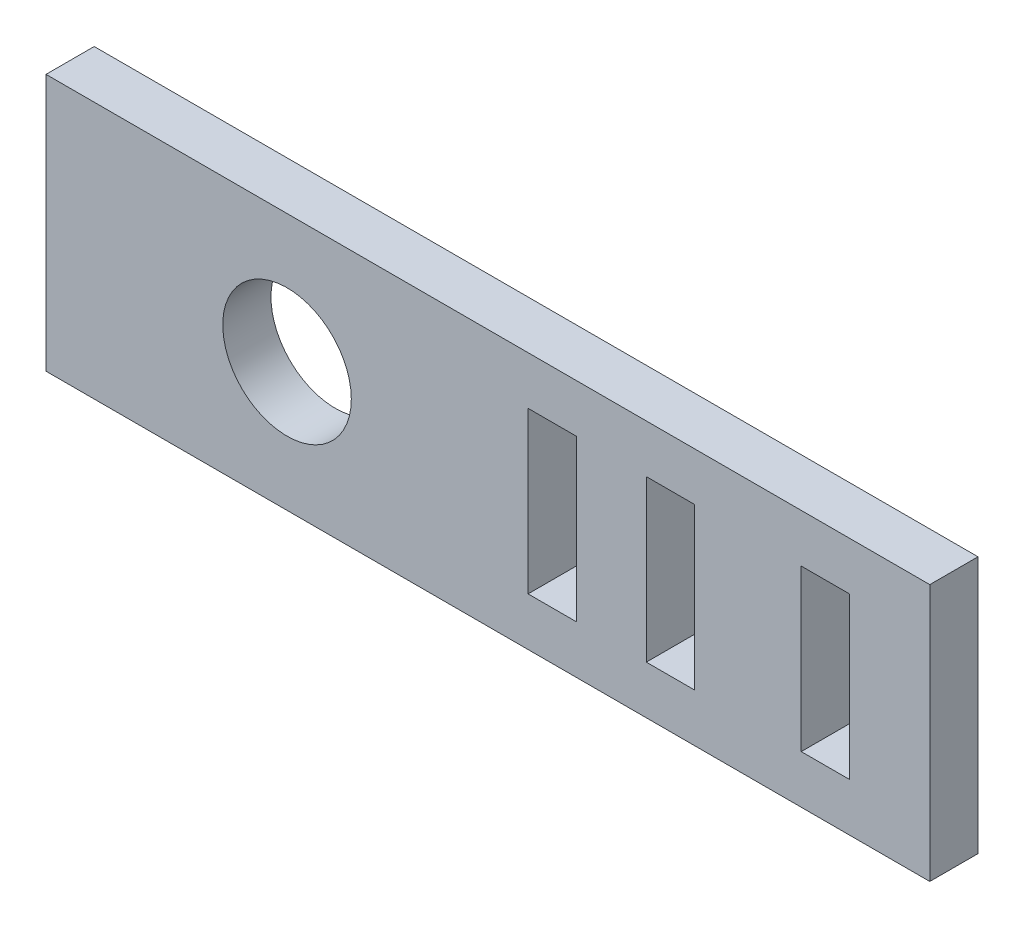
ISO-10303-21;
HEADER;
FILE_DESCRIPTION(('STEP AP214'),'2;1');
FILE_NAME('part.step','',(''),(''),'','','');
FILE_SCHEMA(('AUTOMOTIVE_DESIGN { 1 0 10303 214 1 1 1 1 }'));
ENDSEC;
DATA;
#1=APPLICATION_CONTEXT('core data for automotive mechanical design processes');
#2=APPLICATION_PROTOCOL_DEFINITION('international standard','automotive_design',2000,#1);
#3=PRODUCT_CONTEXT('',#1,'mechanical');
#4=PRODUCT('Part','Part','',(#3));
#5=PRODUCT_RELATED_PRODUCT_CATEGORY('part','',(#4));
#6=PRODUCT_DEFINITION_FORMATION('','',#4);
#7=PRODUCT_DEFINITION_CONTEXT('part definition',#1,'design');
#8=PRODUCT_DEFINITION('design','',#6,#7);
#9=PRODUCT_DEFINITION_SHAPE('','',#8);
#10=(LENGTH_UNIT() NAMED_UNIT(*) SI_UNIT(.MILLI.,.METRE.));
#11=(NAMED_UNIT(*) PLANE_ANGLE_UNIT() SI_UNIT($,.RADIAN.));
#12=(NAMED_UNIT(*) SI_UNIT($,.STERADIAN.) SOLID_ANGLE_UNIT());
#13=UNCERTAINTY_MEASURE_WITH_UNIT(LENGTH_MEASURE(1.E-05),#10,'distance_accuracy_value','');
#14=(GEOMETRIC_REPRESENTATION_CONTEXT(3) GLOBAL_UNCERTAINTY_ASSIGNED_CONTEXT((#13)) GLOBAL_UNIT_ASSIGNED_CONTEXT((#10,
#11,#12)) REPRESENTATION_CONTEXT('',''));
#15=CARTESIAN_POINT('',(0.,0.,0.));
#16=DIRECTION('',(0.,0.,1.));
#17=DIRECTION('',(1.,0.,0.));
#18=AXIS2_PLACEMENT_3D('',#15,#16,#17);
#19=CARTESIAN_POINT('',(0.,0.,0.));
#20=DIRECTION('',(0.,0.,-1.));
#21=DIRECTION('',(-1.,0.,0.));
#22=AXIS2_PLACEMENT_3D('',#19,#20,#21);
#23=PLANE('',#22);
#24=DIRECTION('',(0.,-1.,0.));
#25=VECTOR('',#24,1.);
#26=CARTESIAN_POINT('',(-15.,-8.,0.));
#27=LINE('',#26,#25);
#28=CARTESIAN_POINT('',(-15.,7.99999999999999,0.));
#29=VERTEX_POINT('',#28);
#30=CARTESIAN_POINT('',(-15.,-8.,0.));
#31=VERTEX_POINT('',#30);
#32=EDGE_CURVE('E252',#29,#31,#27,.T.);
#33=ORIENTED_EDGE('',*,*,#32,.F.);
#34=DIRECTION('',(-1.,0.,0.));
#35=VECTOR('',#34,1.);
#36=CARTESIAN_POINT('',(-15.,7.99999999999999,0.));
#37=LINE('',#36,#35);
#38=CARTESIAN_POINT('',(40.,8.,0.));
#39=VERTEX_POINT('',#38);
#40=EDGE_CURVE('E259',#39,#29,#37,.T.);
#41=ORIENTED_EDGE('',*,*,#40,.F.);
#42=DIRECTION('',(0.,1.,0.));
#43=VECTOR('',#42,1.);
#44=CARTESIAN_POINT('',(40.,-8.,0.));
#45=LINE('',#44,#43);
#46=CARTESIAN_POINT('',(40.,-8.,0.));
#47=VERTEX_POINT('',#46);
#48=EDGE_CURVE('E270',#47,#39,#45,.T.);
#49=ORIENTED_EDGE('',*,*,#48,.F.);
#50=DIRECTION('',(1.,0.,0.));
#51=VECTOR('',#50,1.);
#52=CARTESIAN_POINT('',(-15.,-8.,0.));
#53=LINE('',#52,#51);
#54=EDGE_CURVE('E268',#31,#47,#53,.T.);
#55=ORIENTED_EDGE('',*,*,#54,.F.);
#56=EDGE_LOOP('',(#33,#41,#49,#55));
#57=FACE_BOUND('',#56,.T.);
#58=CARTESIAN_POINT('',(0.,0.,0.));
#59=DIRECTION('',(0.,0.,1.));
#60=DIRECTION('',(1.,0.,0.));
#61=AXIS2_PLACEMENT_3D('',#58,#59,#60);
#62=CIRCLE('',#61,4.);
#63=CARTESIAN_POINT('',(4.,0.,0.));
#64=VERTEX_POINT('',#63);
#65=EDGE_CURVE('E248',#64,#64,#62,.T.);
#66=ORIENTED_EDGE('',*,*,#65,.T.);
#67=EDGE_LOOP('',(#66));
#68=FACE_BOUND('',#67,.T.);
#69=DIRECTION('',(-1.,0.,0.));
#70=VECTOR('',#69,1.);
#71=CARTESIAN_POINT('',(25.3580315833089,-5.,0.));
#72=LINE('',#71,#70);
#73=CARTESIAN_POINT('',(25.3580315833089,-5.,0.));
#74=VERTEX_POINT('',#73);
#75=CARTESIAN_POINT('',(22.3580315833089,-5.,0.));
#76=VERTEX_POINT('',#75);
#77=EDGE_CURVE('E238',#74,#76,#72,.T.);
#78=ORIENTED_EDGE('',*,*,#77,.F.);
#79=DIRECTION('',(0.,1.,0.));
#80=VECTOR('',#79,1.);
#81=CARTESIAN_POINT('',(25.3580315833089,-5.,0.));
#82=LINE('',#81,#80);
#83=CARTESIAN_POINT('',(25.3580315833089,5.,0.));
#84=VERTEX_POINT('',#83);
#85=EDGE_CURVE('E220',#74,#84,#82,.T.);
#86=ORIENTED_EDGE('',*,*,#85,.T.);
#87=DIRECTION('',(-1.,0.,0.));
#88=VECTOR('',#87,1.);
#89=CARTESIAN_POINT('',(25.3580315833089,5.,0.));
#90=LINE('',#89,#88);
#91=CARTESIAN_POINT('',(22.3580315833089,5.,0.));
#92=VERTEX_POINT('',#91);
#93=EDGE_CURVE('E235',#84,#92,#90,.T.);
#94=ORIENTED_EDGE('',*,*,#93,.T.);
#95=DIRECTION('',(0.,1.,0.));
#96=VECTOR('',#95,1.);
#97=CARTESIAN_POINT('',(22.3580315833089,-5.,0.));
#98=LINE('',#97,#96);
#99=EDGE_CURVE('E230',#76,#92,#98,.T.);
#100=ORIENTED_EDGE('',*,*,#99,.F.);
#101=EDGE_LOOP('',(#78,#86,#94,#100));
#102=FACE_BOUND('',#101,.T.);
#103=DIRECTION('',(0.,1.,0.));
#104=VECTOR('',#103,1.);
#105=CARTESIAN_POINT('',(32.,0.,0.));
#106=LINE('',#105,#104);
#107=CARTESIAN_POINT('',(32.,-5.,0.));
#108=VERTEX_POINT('',#107);
#109=CARTESIAN_POINT('',(32.,5.,0.));
#110=VERTEX_POINT('',#109);
#111=EDGE_CURVE('E193',#108,#110,#106,.T.);
#112=ORIENTED_EDGE('',*,*,#111,.F.);
#113=DIRECTION('',(-1.,0.,0.));
#114=VECTOR('',#113,1.);
#115=CARTESIAN_POINT('',(35.,-5.,0.));
#116=LINE('',#115,#114);
#117=CARTESIAN_POINT('',(35.,-5.,0.));
#118=VERTEX_POINT('',#117);
#119=EDGE_CURVE('E200',#118,#108,#116,.T.);
#120=ORIENTED_EDGE('',*,*,#119,.F.);
#121=DIRECTION('',(0.,1.,0.));
#122=VECTOR('',#121,1.);
#123=CARTESIAN_POINT('',(35.,0.,0.));
#124=LINE('',#123,#122);
#125=CARTESIAN_POINT('',(35.,5.,0.));
#126=VERTEX_POINT('',#125);
#127=EDGE_CURVE('E194',#118,#126,#124,.T.);
#128=ORIENTED_EDGE('',*,*,#127,.T.);
#129=DIRECTION('',(-1.,0.,0.));
#130=VECTOR('',#129,1.);
#131=CARTESIAN_POINT('',(35.,5.,0.));
#132=LINE('',#131,#130);
#133=EDGE_CURVE('E190',#126,#110,#132,.T.);
#134=ORIENTED_EDGE('',*,*,#133,.T.);
#135=EDGE_LOOP('',(#112,#120,#128,#134));
#136=FACE_BOUND('',#135,.T.);
#137=DIRECTION('',(0.,1.,0.));
#138=VECTOR('',#137,1.);
#139=CARTESIAN_POINT('',(15.,0.,0.));
#140=LINE('',#139,#138);
#141=CARTESIAN_POINT('',(15.,-4.99999999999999,0.));
#142=VERTEX_POINT('',#141);
#143=CARTESIAN_POINT('',(15.,5.00000000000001,0.));
#144=VERTEX_POINT('',#143);
#145=EDGE_CURVE('E156',#142,#144,#140,.T.);
#146=ORIENTED_EDGE('',*,*,#145,.F.);
#147=DIRECTION('',(-1.,0.,0.));
#148=VECTOR('',#147,1.);
#149=CARTESIAN_POINT('',(18.,-4.99999999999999,0.));
#150=LINE('',#149,#148);
#151=CARTESIAN_POINT('',(18.,-4.99999999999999,0.));
#152=VERTEX_POINT('',#151);
#153=EDGE_CURVE('E170',#152,#142,#150,.T.);
#154=ORIENTED_EDGE('',*,*,#153,.F.);
#155=DIRECTION('',(0.,1.,0.));
#156=VECTOR('',#155,1.);
#157=CARTESIAN_POINT('',(18.,0.,0.));
#158=LINE('',#157,#156);
#159=CARTESIAN_POINT('',(18.,5.00000000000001,0.));
#160=VERTEX_POINT('',#159);
#161=EDGE_CURVE('E163',#152,#160,#158,.T.);
#162=ORIENTED_EDGE('',*,*,#161,.T.);
#163=DIRECTION('',(-1.,0.,0.));
#164=VECTOR('',#163,1.);
#165=CARTESIAN_POINT('',(18.,5.00000000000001,0.));
#166=LINE('',#165,#164);
#167=EDGE_CURVE('E148',#160,#144,#166,.T.);
#168=ORIENTED_EDGE('',*,*,#167,.T.);
#169=EDGE_LOOP('',(#146,#154,#162,#168));
#170=FACE_BOUND('',#169,.T.);
#171=ADVANCED_FACE('F37',(#57,#68,#102,#136,#170),#23,.T.);
#172=CARTESIAN_POINT('',(0.,0.,3.));
#173=DIRECTION('',(0.,0.,-1.));
#174=DIRECTION('',(-1.,0.,0.));
#175=AXIS2_PLACEMENT_3D('',#172,#173,#174);
#176=PLANE('',#175);
#177=DIRECTION('',(0.,1.,0.));
#178=VECTOR('',#177,1.);
#179=CARTESIAN_POINT('',(18.,0.,3.));
#180=LINE('',#179,#178);
#181=CARTESIAN_POINT('',(18.,-4.99999999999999,3.));
#182=VERTEX_POINT('',#181);
#183=CARTESIAN_POINT('',(18.,5.00000000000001,3.));
#184=VERTEX_POINT('',#183);
#185=EDGE_CURVE('E166',#182,#184,#180,.T.);
#186=ORIENTED_EDGE('',*,*,#185,.F.);
#187=DIRECTION('',(-1.,0.,0.));
#188=VECTOR('',#187,1.);
#189=CARTESIAN_POINT('',(18.,-4.99999999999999,3.));
#190=LINE('',#189,#188);
#191=CARTESIAN_POINT('',(15.,-4.99999999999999,3.));
#192=VERTEX_POINT('',#191);
#193=EDGE_CURVE('E180',#182,#192,#190,.T.);
#194=ORIENTED_EDGE('',*,*,#193,.T.);
#195=DIRECTION('',(0.,1.,0.));
#196=VECTOR('',#195,1.);
#197=CARTESIAN_POINT('',(15.,0.,3.));
#198=LINE('',#197,#196);
#199=CARTESIAN_POINT('',(15.,5.00000000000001,3.));
#200=VERTEX_POINT('',#199);
#201=EDGE_CURVE('E213',#192,#200,#198,.T.);
#202=ORIENTED_EDGE('',*,*,#201,.T.);
#203=DIRECTION('',(-1.,0.,0.));
#204=VECTOR('',#203,1.);
#205=CARTESIAN_POINT('',(18.,5.00000000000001,3.));
#206=LINE('',#205,#204);
#207=EDGE_CURVE('E157',#184,#200,#206,.T.);
#208=ORIENTED_EDGE('',*,*,#207,.F.);
#209=EDGE_LOOP('',(#186,#194,#202,#208));
#210=FACE_BOUND('',#209,.T.);
#211=DIRECTION('',(0.,1.,0.));
#212=VECTOR('',#211,1.);
#213=CARTESIAN_POINT('',(35.,0.,3.));
#214=LINE('',#213,#212);
#215=CARTESIAN_POINT('',(35.,-4.99999999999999,3.00000000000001));
#216=VERTEX_POINT('',#215);
#217=CARTESIAN_POINT('',(35.,5.00000000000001,3.));
#218=VERTEX_POINT('',#217);
#219=EDGE_CURVE('E210',#216,#218,#214,.T.);
#220=ORIENTED_EDGE('',*,*,#219,.F.);
#221=DIRECTION('',(-1.,0.,0.));
#222=VECTOR('',#221,1.);
#223=CARTESIAN_POINT('',(35.,-4.99999999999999,3.00000000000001));
#224=LINE('',#223,#222);
#225=CARTESIAN_POINT('',(32.,-4.99999999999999,3.00000000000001));
#226=VERTEX_POINT('',#225);
#227=EDGE_CURVE('E205',#216,#226,#224,.T.);
#228=ORIENTED_EDGE('',*,*,#227,.T.);
#229=DIRECTION('',(0.,1.,0.));
#230=VECTOR('',#229,1.);
#231=CARTESIAN_POINT('',(32.,0.,3.));
#232=LINE('',#231,#230);
#233=CARTESIAN_POINT('',(32.,5.00000000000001,3.));
#234=VERTEX_POINT('',#233);
#235=EDGE_CURVE('E183',#226,#234,#232,.T.);
#236=ORIENTED_EDGE('',*,*,#235,.T.);
#237=DIRECTION('',(-1.,0.,0.));
#238=VECTOR('',#237,1.);
#239=CARTESIAN_POINT('',(35.,5.00000000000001,3.));
#240=LINE('',#239,#238);
#241=EDGE_CURVE('E187',#218,#234,#240,.T.);
#242=ORIENTED_EDGE('',*,*,#241,.F.);
#243=EDGE_LOOP('',(#220,#228,#236,#242));
#244=FACE_BOUND('',#243,.T.);
#245=DIRECTION('',(1.,0.,0.));
#246=VECTOR('',#245,1.);
#247=CARTESIAN_POINT('',(-15.,-8.,3.));
#248=LINE('',#247,#246);
#249=CARTESIAN_POINT('',(-15.,-8.,3.));
#250=VERTEX_POINT('',#249);
#251=CARTESIAN_POINT('',(40.,-8.,3.));
#252=VERTEX_POINT('',#251);
#253=EDGE_CURVE('E258',#250,#252,#248,.T.);
#254=ORIENTED_EDGE('',*,*,#253,.T.);
#255=DIRECTION('',(0.,1.,0.));
#256=VECTOR('',#255,1.);
#257=CARTESIAN_POINT('',(40.,-8.,3.));
#258=LINE('',#257,#256);
#259=CARTESIAN_POINT('',(40.,8.,3.));
#260=VERTEX_POINT('',#259);
#261=EDGE_CURVE('E261',#252,#260,#258,.T.);
#262=ORIENTED_EDGE('',*,*,#261,.T.);
#263=DIRECTION('',(-1.,0.,0.));
#264=VECTOR('',#263,1.);
#265=CARTESIAN_POINT('',(-15.,7.99999999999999,3.));
#266=LINE('',#265,#264);
#267=CARTESIAN_POINT('',(-15.,7.99999999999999,3.));
#268=VERTEX_POINT('',#267);
#269=EDGE_CURVE('E263',#260,#268,#266,.T.);
#270=ORIENTED_EDGE('',*,*,#269,.T.);
#271=DIRECTION('',(0.,-1.,0.));
#272=VECTOR('',#271,1.);
#273=CARTESIAN_POINT('',(-15.,-8.,3.));
#274=LINE('',#273,#272);
#275=EDGE_CURVE('E255',#268,#250,#274,.T.);
#276=ORIENTED_EDGE('',*,*,#275,.T.);
#277=EDGE_LOOP('',(#254,#262,#270,#276));
#278=FACE_BOUND('',#277,.T.);
#279=DIRECTION('',(0.,1.,0.));
#280=VECTOR('',#279,1.);
#281=CARTESIAN_POINT('',(25.3580315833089,0.,3.));
#282=LINE('',#281,#280);
#283=CARTESIAN_POINT('',(25.3580315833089,-5.,3.));
#284=VERTEX_POINT('',#283);
#285=CARTESIAN_POINT('',(25.3580315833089,5.,3.));
#286=VERTEX_POINT('',#285);
#287=EDGE_CURVE('E246',#284,#286,#282,.T.);
#288=ORIENTED_EDGE('',*,*,#287,.F.);
#289=DIRECTION('',(-1.,0.,0.));
#290=VECTOR('',#289,1.);
#291=CARTESIAN_POINT('',(25.3580315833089,-5.,3.));
#292=LINE('',#291,#290);
#293=CARTESIAN_POINT('',(22.3580315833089,-5.,3.));
#294=VERTEX_POINT('',#293);
#295=EDGE_CURVE('E240',#284,#294,#292,.T.);
#296=ORIENTED_EDGE('',*,*,#295,.T.);
#297=DIRECTION('',(0.,1.,0.));
#298=VECTOR('',#297,1.);
#299=CARTESIAN_POINT('',(22.3580315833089,0.,3.));
#300=LINE('',#299,#298);
#301=CARTESIAN_POINT('',(22.3580315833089,5.,3.));
#302=VERTEX_POINT('',#301);
#303=EDGE_CURVE('E243',#294,#302,#300,.T.);
#304=ORIENTED_EDGE('',*,*,#303,.T.);
#305=DIRECTION('',(-1.,0.,0.));
#306=VECTOR('',#305,1.);
#307=CARTESIAN_POINT('',(25.3580315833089,5.,3.));
#308=LINE('',#307,#306);
#309=EDGE_CURVE('E227',#286,#302,#308,.T.);
#310=ORIENTED_EDGE('',*,*,#309,.F.);
#311=EDGE_LOOP('',(#288,#296,#304,#310));
#312=FACE_BOUND('',#311,.T.);
#313=CARTESIAN_POINT('',(0.,0.,3.));
#314=DIRECTION('',(0.,0.,1.));
#315=DIRECTION('',(1.,0.,0.));
#316=AXIS2_PLACEMENT_3D('',#313,#314,#315);
#317=CIRCLE('',#316,4.);
#318=CARTESIAN_POINT('',(4.,0.,3.));
#319=VERTEX_POINT('',#318);
#320=EDGE_CURVE('E249',#319,#319,#317,.T.);
#321=ORIENTED_EDGE('',*,*,#320,.F.);
#322=EDGE_LOOP('',(#321));
#323=FACE_BOUND('',#322,.T.);
#324=ADVANCED_FACE('F297',(#210,#244,#278,#312,#323),#176,.F.);
#325=CARTESIAN_POINT('',(-15.,-8.,3.));
#326=DIRECTION('',(1.,0.,0.));
#327=DIRECTION('',(0.,1.,0.));
#328=AXIS2_PLACEMENT_3D('',#325,#326,#327);
#329=PLANE('',#328);
#330=ORIENTED_EDGE('',*,*,#32,.T.);
#331=DIRECTION('',(0.,0.,-1.));
#332=VECTOR('',#331,1.);
#333=CARTESIAN_POINT('',(-15.,-8.,3.));
#334=LINE('',#333,#332);
#335=EDGE_CURVE('E11',#250,#31,#334,.T.);
#336=ORIENTED_EDGE('',*,*,#335,.F.);
#337=ORIENTED_EDGE('',*,*,#275,.F.);
#338=DIRECTION('',(0.,0.,-1.));
#339=VECTOR('',#338,1.);
#340=CARTESIAN_POINT('',(-15.,7.99999999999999,3.));
#341=LINE('',#340,#339);
#342=EDGE_CURVE('E265',#268,#29,#341,.T.);
#343=ORIENTED_EDGE('',*,*,#342,.T.);
#344=EDGE_LOOP('',(#330,#336,#337,#343));
#345=FACE_BOUND('',#344,.T.);
#346=ADVANCED_FACE('F39',(#345),#329,.F.);
#347=CARTESIAN_POINT('',(-15.,-8.,3.));
#348=DIRECTION('',(0.,1.,0.));
#349=DIRECTION('',(0.,0.,1.));
#350=AXIS2_PLACEMENT_3D('',#347,#348,#349);
#351=PLANE('',#350);
#352=ORIENTED_EDGE('',*,*,#54,.T.);
#353=DIRECTION('',(0.,0.,-1.));
#354=VECTOR('',#353,1.);
#355=CARTESIAN_POINT('',(40.,-8.,3.));
#356=LINE('',#355,#354);
#357=EDGE_CURVE('E45',#252,#47,#356,.T.);
#358=ORIENTED_EDGE('',*,*,#357,.F.);
#359=ORIENTED_EDGE('',*,*,#253,.F.);
#360=ORIENTED_EDGE('',*,*,#335,.T.);
#361=EDGE_LOOP('',(#352,#358,#359,#360));
#362=FACE_BOUND('',#361,.T.);
#363=ADVANCED_FACE('F299',(#362),#351,.F.);
#364=CARTESIAN_POINT('',(40.,-8.,3.));
#365=DIRECTION('',(-1.,0.,0.));
#366=DIRECTION('',(0.,0.,1.));
#367=AXIS2_PLACEMENT_3D('',#364,#365,#366);
#368=PLANE('',#367);
#369=ORIENTED_EDGE('',*,*,#48,.T.);
#370=DIRECTION('',(0.,0.,-1.));
#371=VECTOR('',#370,1.);
#372=CARTESIAN_POINT('',(40.,8.,3.));
#373=LINE('',#372,#371);
#374=EDGE_CURVE('E275',#260,#39,#373,.T.);
#375=ORIENTED_EDGE('',*,*,#374,.F.);
#376=ORIENTED_EDGE('',*,*,#261,.F.);
#377=ORIENTED_EDGE('',*,*,#357,.T.);
#378=EDGE_LOOP('',(#369,#375,#376,#377));
#379=FACE_BOUND('',#378,.T.);
#380=ADVANCED_FACE('F282',(#379),#368,.F.);
#381=CARTESIAN_POINT('',(-15.,7.99999999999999,3.));
#382=DIRECTION('',(0.,-1.,0.));
#383=DIRECTION('',(1.,0.,0.));
#384=AXIS2_PLACEMENT_3D('',#381,#382,#383);
#385=PLANE('',#384);
#386=ORIENTED_EDGE('',*,*,#40,.T.);
#387=ORIENTED_EDGE('',*,*,#342,.F.);
#388=ORIENTED_EDGE('',*,*,#269,.F.);
#389=ORIENTED_EDGE('',*,*,#374,.T.);
#390=EDGE_LOOP('',(#386,#387,#388,#389));
#391=FACE_BOUND('',#390,.T.);
#392=ADVANCED_FACE('F291',(#391),#385,.F.);
#393=CARTESIAN_POINT('',(0.,0.,3.));
#394=DIRECTION('',(0.,0.,-1.));
#395=DIRECTION('',(-1.,0.,0.));
#396=AXIS2_PLACEMENT_3D('',#393,#394,#395);
#397=CYLINDRICAL_SURFACE('',#396,4.);
#398=ORIENTED_EDGE('',*,*,#320,.T.);
#399=EDGE_LOOP('',(#398));
#400=FACE_BOUND('',#399,.T.);
#401=ORIENTED_EDGE('',*,*,#65,.F.);
#402=EDGE_LOOP('',(#401));
#403=FACE_BOUND('',#402,.T.);
#404=ADVANCED_FACE('F316',(#400,#403),#397,.F.);
#405=CARTESIAN_POINT('',(25.3580315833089,-8.,13.));
#406=DIRECTION('',(-1.,0.,0.));
#407=DIRECTION('',(0.,0.,1.));
#408=AXIS2_PLACEMENT_3D('',#405,#406,#407);
#409=PLANE('',#408);
#410=ORIENTED_EDGE('',*,*,#287,.T.);
#411=DIRECTION('',(0.,0.,1.));
#412=VECTOR('',#411,1.);
#413=CARTESIAN_POINT('',(25.3580315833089,5.,3.));
#414=LINE('',#413,#412);
#415=EDGE_CURVE('E224',#84,#286,#414,.T.);
#416=ORIENTED_EDGE('',*,*,#415,.F.);
#417=ORIENTED_EDGE('',*,*,#85,.F.);
#418=DIRECTION('',(0.,0.,-1.));
#419=VECTOR('',#418,1.);
#420=CARTESIAN_POINT('',(25.3580315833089,-5.,3.));
#421=LINE('',#420,#419);
#422=EDGE_CURVE('E218',#284,#74,#421,.T.);
#423=ORIENTED_EDGE('',*,*,#422,.F.);
#424=EDGE_LOOP('',(#410,#416,#417,#423));
#425=FACE_BOUND('',#424,.T.);
#426=ADVANCED_FACE('F320',(#425),#409,.T.);
#427=CARTESIAN_POINT('',(22.3580315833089,-8.,13.));
#428=DIRECTION('',(-1.,0.,0.));
#429=DIRECTION('',(0.,0.,1.));
#430=AXIS2_PLACEMENT_3D('',#427,#428,#429);
#431=PLANE('',#430);
#432=DIRECTION('',(0.,0.,-1.));
#433=VECTOR('',#432,1.);
#434=CARTESIAN_POINT('',(22.3580315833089,-5.,3.));
#435=LINE('',#434,#433);
#436=EDGE_CURVE('E217',#294,#76,#435,.T.);
#437=ORIENTED_EDGE('',*,*,#436,.T.);
#438=ORIENTED_EDGE('',*,*,#99,.T.);
#439=DIRECTION('',(0.,0.,1.));
#440=VECTOR('',#439,1.);
#441=CARTESIAN_POINT('',(22.3580315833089,5.,3.));
#442=LINE('',#441,#440);
#443=EDGE_CURVE('E221',#92,#302,#442,.T.);
#444=ORIENTED_EDGE('',*,*,#443,.T.);
#445=ORIENTED_EDGE('',*,*,#303,.F.);
#446=EDGE_LOOP('',(#437,#438,#444,#445));
#447=FACE_BOUND('',#446,.T.);
#448=ADVANCED_FACE('F325',(#447),#431,.F.);
#449=CARTESIAN_POINT('',(25.3580315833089,-5.,3.));
#450=DIRECTION('',(0.,1.,0.));
#451=DIRECTION('',(1.,0.,0.));
#452=AXIS2_PLACEMENT_3D('',#449,#450,#451);
#453=PLANE('',#452);
#454=ORIENTED_EDGE('',*,*,#436,.F.);
#455=ORIENTED_EDGE('',*,*,#295,.F.);
#456=ORIENTED_EDGE('',*,*,#422,.T.);
#457=ORIENTED_EDGE('',*,*,#77,.T.);
#458=EDGE_LOOP('',(#454,#455,#456,#457));
#459=FACE_BOUND('',#458,.T.);
#460=ADVANCED_FACE('F330',(#459),#453,.T.);
#461=CARTESIAN_POINT('',(25.3580315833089,5.,3.));
#462=DIRECTION('',(0.,-1.,0.));
#463=DIRECTION('',(-1.,0.,0.));
#464=AXIS2_PLACEMENT_3D('',#461,#462,#463);
#465=PLANE('',#464);
#466=ORIENTED_EDGE('',*,*,#443,.F.);
#467=ORIENTED_EDGE('',*,*,#93,.F.);
#468=ORIENTED_EDGE('',*,*,#415,.T.);
#469=ORIENTED_EDGE('',*,*,#309,.T.);
#470=EDGE_LOOP('',(#466,#467,#468,#469));
#471=FACE_BOUND('',#470,.T.);
#472=ADVANCED_FACE('F333',(#471),#465,.T.);
#473=CARTESIAN_POINT('',(35.,0.,0.));
#474=DIRECTION('',(-1.,0.,0.));
#475=DIRECTION('',(0.,-1.,0.));
#476=AXIS2_PLACEMENT_3D('',#473,#474,#475);
#477=PLANE('',#476);
#478=ORIENTED_EDGE('',*,*,#219,.T.);
#479=DIRECTION('',(0.,0.,-1.));
#480=VECTOR('',#479,1.);
#481=CARTESIAN_POINT('',(35.,5.,0.));
#482=LINE('',#481,#480);
#483=EDGE_CURVE('E184',#218,#126,#482,.T.);
#484=ORIENTED_EDGE('',*,*,#483,.T.);
#485=ORIENTED_EDGE('',*,*,#127,.F.);
#486=DIRECTION('',(0.,0.,-1.));
#487=VECTOR('',#486,1.);
#488=CARTESIAN_POINT('',(35.,-5.,0.));
#489=LINE('',#488,#487);
#490=EDGE_CURVE('E197',#216,#118,#489,.T.);
#491=ORIENTED_EDGE('',*,*,#490,.F.);
#492=EDGE_LOOP('',(#478,#484,#485,#491));
#493=FACE_BOUND('',#492,.T.);
#494=ADVANCED_FACE('F337',(#493),#477,.T.);
#495=CARTESIAN_POINT('',(32.,0.,0.));
#496=DIRECTION('',(-1.,0.,0.));
#497=DIRECTION('',(0.,-1.,0.));
#498=AXIS2_PLACEMENT_3D('',#495,#496,#497);
#499=PLANE('',#498);
#500=DIRECTION('',(0.,0.,-1.));
#501=VECTOR('',#500,1.);
#502=CARTESIAN_POINT('',(32.,-5.,0.));
#503=LINE('',#502,#501);
#504=EDGE_CURVE('E198',#226,#108,#503,.T.);
#505=ORIENTED_EDGE('',*,*,#504,.T.);
#506=ORIENTED_EDGE('',*,*,#111,.T.);
#507=DIRECTION('',(0.,0.,-1.));
#508=VECTOR('',#507,1.);
#509=CARTESIAN_POINT('',(32.,5.,0.));
#510=LINE('',#509,#508);
#511=EDGE_CURVE('E60',#234,#110,#510,.T.);
#512=ORIENTED_EDGE('',*,*,#511,.F.);
#513=ORIENTED_EDGE('',*,*,#235,.F.);
#514=EDGE_LOOP('',(#505,#506,#512,#513));
#515=FACE_BOUND('',#514,.T.);
#516=ADVANCED_FACE('F346',(#515),#499,.F.);
#517=CARTESIAN_POINT('',(35.,-5.,0.));
#518=DIRECTION('',(0.,1.,0.));
#519=DIRECTION('',(-1.,0.,0.));
#520=AXIS2_PLACEMENT_3D('',#517,#518,#519);
#521=PLANE('',#520);
#522=ORIENTED_EDGE('',*,*,#504,.F.);
#523=ORIENTED_EDGE('',*,*,#227,.F.);
#524=ORIENTED_EDGE('',*,*,#490,.T.);
#525=ORIENTED_EDGE('',*,*,#119,.T.);
#526=EDGE_LOOP('',(#522,#523,#524,#525));
#527=FACE_BOUND('',#526,.T.);
#528=ADVANCED_FACE('F342',(#527),#521,.T.);
#529=CARTESIAN_POINT('',(35.,5.,0.));
#530=DIRECTION('',(0.,1.,0.));
#531=DIRECTION('',(-1.,0.,0.));
#532=AXIS2_PLACEMENT_3D('',#529,#530,#531);
#533=PLANE('',#532);
#534=ORIENTED_EDGE('',*,*,#511,.T.);
#535=ORIENTED_EDGE('',*,*,#133,.F.);
#536=ORIENTED_EDGE('',*,*,#483,.F.);
#537=ORIENTED_EDGE('',*,*,#241,.T.);
#538=EDGE_LOOP('',(#534,#535,#536,#537));
#539=FACE_BOUND('',#538,.T.);
#540=ADVANCED_FACE('F345',(#539),#533,.F.);
#541=CARTESIAN_POINT('',(18.,0.,0.));
#542=DIRECTION('',(-1.,0.,0.));
#543=DIRECTION('',(0.,-1.,0.));
#544=AXIS2_PLACEMENT_3D('',#541,#542,#543);
#545=PLANE('',#544);
#546=ORIENTED_EDGE('',*,*,#185,.T.);
#547=DIRECTION('',(0.,0.,-1.));
#548=VECTOR('',#547,1.);
#549=CARTESIAN_POINT('',(18.,5.00000000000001,0.));
#550=LINE('',#549,#548);
#551=EDGE_CURVE('E151',#184,#160,#550,.T.);
#552=ORIENTED_EDGE('',*,*,#551,.T.);
#553=ORIENTED_EDGE('',*,*,#161,.F.);
#554=DIRECTION('',(0.,0.,-1.));
#555=VECTOR('',#554,1.);
#556=CARTESIAN_POINT('',(18.,-4.99999999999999,0.));
#557=LINE('',#556,#555);
#558=EDGE_CURVE('E171',#182,#152,#557,.T.);
#559=ORIENTED_EDGE('',*,*,#558,.F.);
#560=EDGE_LOOP('',(#546,#552,#553,#559));
#561=FACE_BOUND('',#560,.T.);
#562=ADVANCED_FACE('F161',(#561),#545,.T.);
#563=CARTESIAN_POINT('',(15.,0.,0.));
#564=DIRECTION('',(-1.,0.,0.));
#565=DIRECTION('',(0.,-1.,0.));
#566=AXIS2_PLACEMENT_3D('',#563,#564,#565);
#567=PLANE('',#566);
#568=DIRECTION('',(0.,0.,-1.));
#569=VECTOR('',#568,1.);
#570=CARTESIAN_POINT('',(15.,-4.99999999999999,0.));
#571=LINE('',#570,#569);
#572=EDGE_CURVE('E172',#192,#142,#571,.T.);
#573=ORIENTED_EDGE('',*,*,#572,.T.);
#574=ORIENTED_EDGE('',*,*,#145,.T.);
#575=DIRECTION('',(0.,0.,-1.));
#576=VECTOR('',#575,1.);
#577=CARTESIAN_POINT('',(15.,5.00000000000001,0.));
#578=LINE('',#577,#576);
#579=EDGE_CURVE('E52',#200,#144,#578,.T.);
#580=ORIENTED_EDGE('',*,*,#579,.F.);
#581=ORIENTED_EDGE('',*,*,#201,.F.);
#582=EDGE_LOOP('',(#573,#574,#580,#581));
#583=FACE_BOUND('',#582,.T.);
#584=ADVANCED_FACE('F359',(#583),#567,.F.);
#585=CARTESIAN_POINT('',(18.,-4.99999999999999,0.));
#586=DIRECTION('',(0.,1.,0.));
#587=DIRECTION('',(-1.,0.,0.));
#588=AXIS2_PLACEMENT_3D('',#585,#586,#587);
#589=PLANE('',#588);
#590=ORIENTED_EDGE('',*,*,#572,.F.);
#591=ORIENTED_EDGE('',*,*,#193,.F.);
#592=ORIENTED_EDGE('',*,*,#558,.T.);
#593=ORIENTED_EDGE('',*,*,#153,.T.);
#594=EDGE_LOOP('',(#590,#591,#592,#593));
#595=FACE_BOUND('',#594,.T.);
#596=ADVANCED_FACE('F356',(#595),#589,.T.);
#597=CARTESIAN_POINT('',(18.,5.00000000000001,0.));
#598=DIRECTION('',(0.,1.,0.));
#599=DIRECTION('',(-1.,0.,0.));
#600=AXIS2_PLACEMENT_3D('',#597,#598,#599);
#601=PLANE('',#600);
#602=ORIENTED_EDGE('',*,*,#579,.T.);
#603=ORIENTED_EDGE('',*,*,#167,.F.);
#604=ORIENTED_EDGE('',*,*,#551,.F.);
#605=ORIENTED_EDGE('',*,*,#207,.T.);
#606=EDGE_LOOP('',(#602,#603,#604,#605));
#607=FACE_BOUND('',#606,.T.);
#608=ADVANCED_FACE('F150',(#607),#601,.F.);
#609=CLOSED_SHELL('',(#171,#324,#346,#363,#380,#392,#404,#426,#448,#460,#472,#494,#516,#528,
#540,#562,#584,#596,#608));
#610=MANIFOLD_SOLID_BREP('B2',#609);
#611=ADVANCED_BREP_SHAPE_REPRESENTATION('',(#18,#610),#14);
#612=SHAPE_DEFINITION_REPRESENTATION(#9,#611);
ENDSEC;
END-ISO-10303-21;
